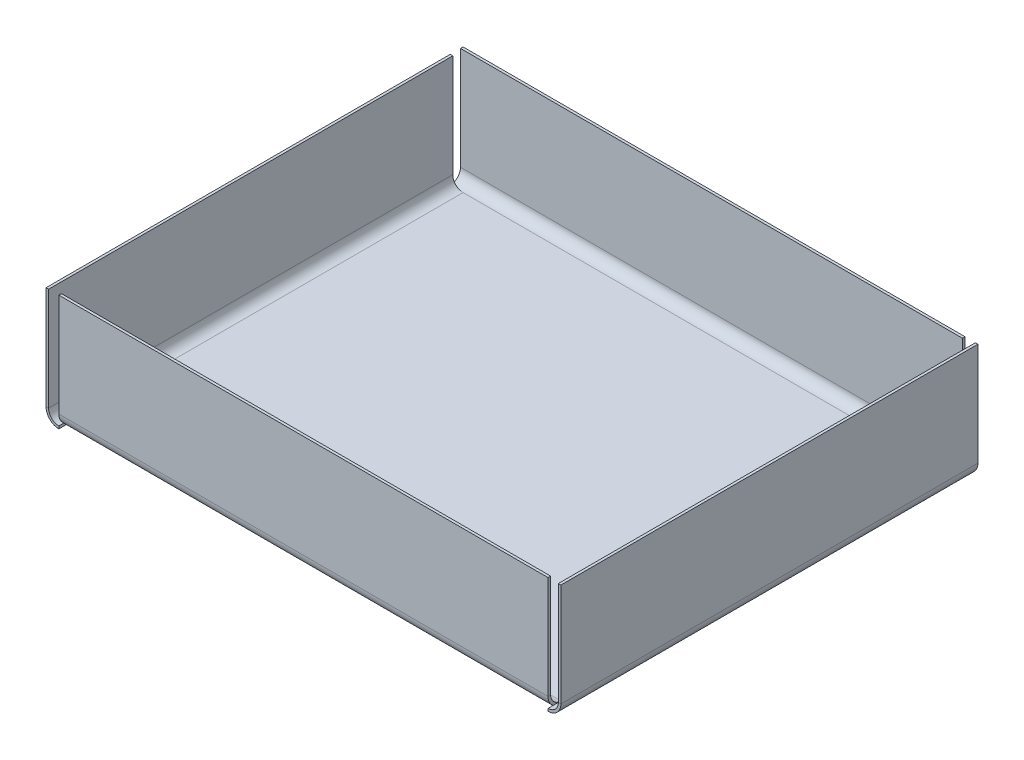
ISO-10303-21;
HEADER;
FILE_DESCRIPTION(('STEP AP214'),'2;1');
FILE_NAME('part.step','',(''),(''),'','','');
FILE_SCHEMA(('AUTOMOTIVE_DESIGN { 1 0 10303 214 1 1 1 1 }'));
ENDSEC;
DATA;
#1=APPLICATION_CONTEXT('core data for automotive mechanical design processes');
#2=APPLICATION_PROTOCOL_DEFINITION('international standard','automotive_design',2000,#1);
#3=PRODUCT_CONTEXT('',#1,'mechanical');
#4=PRODUCT('Part','Part','',(#3));
#5=PRODUCT_RELATED_PRODUCT_CATEGORY('part','',(#4));
#6=PRODUCT_DEFINITION_FORMATION('','',#4);
#7=PRODUCT_DEFINITION_CONTEXT('part definition',#1,'design');
#8=PRODUCT_DEFINITION('design','',#6,#7);
#9=PRODUCT_DEFINITION_SHAPE('','',#8);
#10=(LENGTH_UNIT() NAMED_UNIT(*) SI_UNIT(.MILLI.,.METRE.));
#11=(NAMED_UNIT(*) PLANE_ANGLE_UNIT() SI_UNIT($,.RADIAN.));
#12=(NAMED_UNIT(*) SI_UNIT($,.STERADIAN.) SOLID_ANGLE_UNIT());
#13=UNCERTAINTY_MEASURE_WITH_UNIT(LENGTH_MEASURE(1.E-05),#10,'distance_accuracy_value','');
#14=(GEOMETRIC_REPRESENTATION_CONTEXT(3) GLOBAL_UNCERTAINTY_ASSIGNED_CONTEXT((#13)) GLOBAL_UNIT_ASSIGNED_CONTEXT((#10,
#11,#12)) REPRESENTATION_CONTEXT('',''));
#15=CARTESIAN_POINT('',(0.,0.,0.));
#16=DIRECTION('',(0.,0.,1.));
#17=DIRECTION('',(1.,0.,0.));
#18=AXIS2_PLACEMENT_3D('',#15,#16,#17);
#19=CARTESIAN_POINT('',(97.5,1.99999999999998,78.5));
#20=DIRECTION('',(-1.,0.,0.));
#21=DIRECTION('',(0.,-1.,0.));
#22=AXIS2_PLACEMENT_3D('',#19,#20,#21);
#23=PLANE('',#22);
#24=CARTESIAN_POINT('',(97.5,1.99999999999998,78.5));
#25=DIRECTION('',(1.,0.,0.));
#26=DIRECTION('',(0.,1.,0.));
#27=AXIS2_PLACEMENT_3D('',#24,#25,#26);
#28=CIRCLE('',#27,2.5);
#29=CARTESIAN_POINT('',(97.5,1.99999999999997,81.));
#30=VERTEX_POINT('',#29);
#31=CARTESIAN_POINT('',(97.5,0.,80.));
#32=VERTEX_POINT('',#31);
#33=EDGE_CURVE('E36',#30,#32,#28,.T.);
#34=ORIENTED_EDGE('',*,*,#33,.T.);
#35=DIRECTION('',(0.,0.,-1.));
#36=VECTOR('',#35,1.);
#37=CARTESIAN_POINT('',(97.5,0.,81.));
#38=LINE('',#37,#36);
#39=CARTESIAN_POINT('',(97.5,0.,78.5));
#40=VERTEX_POINT('',#39);
#41=EDGE_CURVE('E11',#32,#40,#38,.T.);
#42=ORIENTED_EDGE('',*,*,#41,.T.);
#43=CARTESIAN_POINT('',(97.5,1.99999999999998,78.5));
#44=DIRECTION('',(1.,0.,0.));
#45=DIRECTION('',(0.,1.,0.));
#46=AXIS2_PLACEMENT_3D('',#43,#44,#45);
#47=CIRCLE('',#46,2.);
#48=CARTESIAN_POINT('',(97.5,1.99999999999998,80.5));
#49=VERTEX_POINT('',#48);
#50=EDGE_CURVE('E424',#49,#40,#47,.T.);
#51=ORIENTED_EDGE('',*,*,#50,.F.);
#52=DIRECTION('',(0.,0.,-1.));
#53=VECTOR('',#52,1.);
#54=CARTESIAN_POINT('',(97.5,1.99999999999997,80.5));
#55=LINE('',#54,#53);
#56=EDGE_CURVE('E242',#49,#30,#55,.F.);
#57=ORIENTED_EDGE('',*,*,#56,.T.);
#58=EDGE_LOOP('',(#34,#42,#51,#57));
#59=FACE_BOUND('',#58,.T.);
#60=ADVANCED_FACE('F33',(#59),#23,.F.);
#61=CARTESIAN_POINT('',(2.5,2.,78.5));
#62=DIRECTION('',(-1.,0.,0.));
#63=DIRECTION('',(0.,-1.,0.));
#64=AXIS2_PLACEMENT_3D('',#61,#62,#63);
#65=PLANE('',#64);
#66=DIRECTION('',(0.,0.,1.));
#67=VECTOR('',#66,1.);
#68=CARTESIAN_POINT('',(2.49999999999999,0.,81.));
#69=LINE('',#68,#67);
#70=CARTESIAN_POINT('',(2.5,0.,80.));
#71=VERTEX_POINT('',#70);
#72=CARTESIAN_POINT('',(2.5,0.,78.5));
#73=VERTEX_POINT('',#72);
#74=EDGE_CURVE('E41',#71,#73,#69,.F.);
#75=ORIENTED_EDGE('',*,*,#74,.F.);
#76=CARTESIAN_POINT('',(2.5,2.,78.5));
#77=DIRECTION('',(1.,0.,0.));
#78=DIRECTION('',(0.,1.,0.));
#79=AXIS2_PLACEMENT_3D('',#76,#77,#78);
#80=CIRCLE('',#79,2.5);
#81=CARTESIAN_POINT('',(2.5,2.,81.));
#82=VERTEX_POINT('',#81);
#83=EDGE_CURVE('E429',#71,#82,#80,.F.);
#84=ORIENTED_EDGE('',*,*,#83,.T.);
#85=DIRECTION('',(0.,0.,-1.));
#86=VECTOR('',#85,1.);
#87=CARTESIAN_POINT('',(2.49999999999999,2.,81.));
#88=LINE('',#87,#86);
#89=CARTESIAN_POINT('',(2.5,2.,80.5));
#90=VERTEX_POINT('',#89);
#91=EDGE_CURVE('E230',#90,#82,#88,.F.);
#92=ORIENTED_EDGE('',*,*,#91,.F.);
#93=CARTESIAN_POINT('',(2.5,2.,78.5));
#94=DIRECTION('',(1.,0.,0.));
#95=DIRECTION('',(0.,1.,0.));
#96=AXIS2_PLACEMENT_3D('',#93,#94,#95);
#97=CIRCLE('',#96,2.);
#98=EDGE_CURVE('E418',#73,#90,#97,.F.);
#99=ORIENTED_EDGE('',*,*,#98,.F.);
#100=EDGE_LOOP('',(#75,#84,#92,#99));
#101=FACE_BOUND('',#100,.T.);
#102=ADVANCED_FACE('F433',(#101),#65,.T.);
#103=CARTESIAN_POINT('',(97.5,1.99999999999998,78.5));
#104=DIRECTION('',(1.,0.,0.));
#105=DIRECTION('',(0.,0.,1.));
#106=AXIS2_PLACEMENT_3D('',#103,#104,#105);
#107=CYLINDRICAL_SURFACE('',#106,2.5);
#108=DIRECTION('',(1.,0.,0.));
#109=VECTOR('',#108,1.);
#110=CARTESIAN_POINT('',(97.5,-0.500000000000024,78.5));
#111=LINE('',#110,#109);
#112=CARTESIAN_POINT('',(97.5,-0.500000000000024,78.5));
#113=VERTEX_POINT('',#112);
#114=CARTESIAN_POINT('',(2.5,-0.500000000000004,78.5));
#115=VERTEX_POINT('',#114);
#116=EDGE_CURVE('E427',#113,#115,#111,.F.);
#117=ORIENTED_EDGE('',*,*,#116,.F.);
#118=EDGE_CURVE('E50',#32,#113,#28,.T.);
#119=ORIENTED_EDGE('',*,*,#118,.F.);
#120=ORIENTED_EDGE('',*,*,#33,.F.);
#121=DIRECTION('',(1.,0.,0.));
#122=VECTOR('',#121,1.);
#123=CARTESIAN_POINT('',(2.49999999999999,2.,81.));
#124=LINE('',#123,#122);
#125=EDGE_CURVE('E239',#30,#82,#124,.F.);
#126=ORIENTED_EDGE('',*,*,#125,.T.);
#127=ORIENTED_EDGE('',*,*,#83,.F.);
#128=EDGE_CURVE('E430',#115,#71,#80,.F.);
#129=ORIENTED_EDGE('',*,*,#128,.F.);
#130=EDGE_LOOP('',(#117,#119,#120,#126,#127,#129));
#131=FACE_BOUND('',#130,.T.);
#132=ADVANCED_FACE('F434',(#131),#107,.T.);
#133=CARTESIAN_POINT('',(97.5,1.99999999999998,78.5));
#134=DIRECTION('',(1.,0.,0.));
#135=DIRECTION('',(0.,0.,1.));
#136=AXIS2_PLACEMENT_3D('',#133,#134,#135);
#137=CYLINDRICAL_SURFACE('',#136,2.);
#138=DIRECTION('',(1.,0.,0.));
#139=VECTOR('',#138,1.);
#140=CARTESIAN_POINT('',(97.5,0.,78.5));
#141=LINE('',#140,#139);
#142=EDGE_CURVE('E421',#40,#73,#141,.F.);
#143=ORIENTED_EDGE('',*,*,#142,.T.);
#144=ORIENTED_EDGE('',*,*,#98,.T.);
#145=DIRECTION('',(1.,0.,0.));
#146=VECTOR('',#145,1.);
#147=CARTESIAN_POINT('',(2.49999999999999,2.,80.5));
#148=LINE('',#147,#146);
#149=EDGE_CURVE('E245',#90,#49,#148,.T.);
#150=ORIENTED_EDGE('',*,*,#149,.T.);
#151=ORIENTED_EDGE('',*,*,#50,.T.);
#152=EDGE_LOOP('',(#143,#144,#150,#151));
#153=FACE_BOUND('',#152,.T.);
#154=ADVANCED_FACE('F445',(#153),#137,.F.);
#155=CARTESIAN_POINT('',(0.,-0.5,81.));
#156=DIRECTION('',(0.,1.,0.));
#157=DIRECTION('',(0.,0.,1.));
#158=AXIS2_PLACEMENT_3D('',#155,#156,#157);
#159=PLANE('',#158);
#160=ORIENTED_EDGE('',*,*,#116,.T.);
#161=DIRECTION('',(0.,0.,1.));
#162=VECTOR('',#161,1.);
#163=CARTESIAN_POINT('',(2.49999999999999,-0.499999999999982,81.));
#164=LINE('',#163,#162);
#165=CARTESIAN_POINT('',(2.49999999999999,-0.499999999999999,2.5));
#166=VERTEX_POINT('',#165);
#167=EDGE_CURVE('E410',#115,#166,#164,.F.);
#168=ORIENTED_EDGE('',*,*,#167,.T.);
#169=DIRECTION('',(-1.,0.,0.));
#170=VECTOR('',#169,1.);
#171=CARTESIAN_POINT('',(0.,-0.500000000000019,2.49999999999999));
#172=LINE('',#171,#170);
#173=CARTESIAN_POINT('',(97.5,-0.500000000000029,2.49999999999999));
#174=VERTEX_POINT('',#173);
#175=EDGE_CURVE('E386',#166,#174,#172,.F.);
#176=ORIENTED_EDGE('',*,*,#175,.T.);
#177=DIRECTION('',(0.,0.,-1.));
#178=VECTOR('',#177,1.);
#179=CARTESIAN_POINT('',(97.5,-0.500000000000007,0.));
#180=LINE('',#179,#178);
#181=EDGE_CURVE('E360',#174,#113,#180,.F.);
#182=ORIENTED_EDGE('',*,*,#181,.T.);
#183=EDGE_LOOP('',(#160,#168,#176,#182));
#184=FACE_BOUND('',#183,.T.);
#185=ADVANCED_FACE('F518',(#184),#159,.F.);
#186=CARTESIAN_POINT('',(0.,0.,81.));
#187=DIRECTION('',(0.,1.,0.));
#188=DIRECTION('',(0.,0.,1.));
#189=AXIS2_PLACEMENT_3D('',#186,#187,#188);
#190=PLANE('',#189);
#191=CARTESIAN_POINT('',(2.49999999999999,0.,2.49999999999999));
#192=VERTEX_POINT('',#191);
#193=EDGE_CURVE('E402',#73,#192,#69,.F.);
#194=ORIENTED_EDGE('',*,*,#193,.F.);
#195=ORIENTED_EDGE('',*,*,#142,.F.);
#196=DIRECTION('',(0.,0.,-1.));
#197=VECTOR('',#196,1.);
#198=CARTESIAN_POINT('',(97.5,0.,0.));
#199=LINE('',#198,#197);
#200=CARTESIAN_POINT('',(97.5,0.,2.49999999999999));
#201=VERTEX_POINT('',#200);
#202=EDGE_CURVE('E352',#201,#40,#199,.F.);
#203=ORIENTED_EDGE('',*,*,#202,.F.);
#204=DIRECTION('',(-1.,0.,0.));
#205=VECTOR('',#204,1.);
#206=CARTESIAN_POINT('',(0.,0.,2.49999999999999));
#207=LINE('',#206,#205);
#208=EDGE_CURVE('E378',#192,#201,#207,.F.);
#209=ORIENTED_EDGE('',*,*,#208,.F.);
#210=EDGE_LOOP('',(#194,#195,#203,#209));
#211=FACE_BOUND('',#210,.T.);
#212=ADVANCED_FACE('F500',(#211),#190,.T.);
#213=CARTESIAN_POINT('',(2.49999999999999,2.,2.5));
#214=DIRECTION('',(0.,0.,-1.));
#215=DIRECTION('',(0.,1.,0.));
#216=AXIS2_PLACEMENT_3D('',#213,#214,#215);
#217=PLANE('',#216);
#218=CARTESIAN_POINT('',(1.00000000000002,0.,2.5));
#219=VERTEX_POINT('',#218);
#220=EDGE_CURVE('E379',#219,#192,#207,.F.);
#221=ORIENTED_EDGE('',*,*,#220,.F.);
#222=CARTESIAN_POINT('',(2.49999999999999,2.,2.5));
#223=DIRECTION('',(0.,0.,1.));
#224=DIRECTION('',(0.,-1.,0.));
#225=AXIS2_PLACEMENT_3D('',#222,#223,#224);
#226=CIRCLE('',#225,2.5);
#227=CARTESIAN_POINT('',(0.,1.99999999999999,2.5));
#228=VERTEX_POINT('',#227);
#229=EDGE_CURVE('E409',#219,#228,#226,.F.);
#230=ORIENTED_EDGE('',*,*,#229,.T.);
#231=DIRECTION('',(1.,0.,0.));
#232=VECTOR('',#231,1.);
#233=CARTESIAN_POINT('',(0.,1.99999999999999,2.49999999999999));
#234=LINE('',#233,#232);
#235=CARTESIAN_POINT('',(0.499999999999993,1.99999999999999,2.5));
#236=VERTEX_POINT('',#235);
#237=EDGE_CURVE('E252',#236,#228,#234,.F.);
#238=ORIENTED_EDGE('',*,*,#237,.F.);
#239=CARTESIAN_POINT('',(2.49999999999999,2.,2.5));
#240=DIRECTION('',(0.,0.,1.));
#241=DIRECTION('',(0.,-1.,0.));
#242=AXIS2_PLACEMENT_3D('',#239,#240,#241);
#243=CIRCLE('',#242,2.);
#244=EDGE_CURVE('E395',#192,#236,#243,.F.);
#245=ORIENTED_EDGE('',*,*,#244,.F.);
#246=EDGE_LOOP('',(#221,#230,#238,#245));
#247=FACE_BOUND('',#246,.T.);
#248=ADVANCED_FACE('F571',(#247),#217,.T.);
#249=CARTESIAN_POINT('',(2.49999999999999,2.00000000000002,81.));
#250=DIRECTION('',(0.,0.,-1.));
#251=DIRECTION('',(0.,1.,0.));
#252=AXIS2_PLACEMENT_3D('',#249,#250,#251);
#253=PLANE('',#252);
#254=CARTESIAN_POINT('',(2.49999999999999,2.00000000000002,81.));
#255=DIRECTION('',(0.,0.,1.));
#256=DIRECTION('',(0.,-1.,0.));
#257=AXIS2_PLACEMENT_3D('',#254,#255,#256);
#258=CIRCLE('',#257,2.);
#259=CARTESIAN_POINT('',(0.499999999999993,2.00000000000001,81.));
#260=VERTEX_POINT('',#259);
#261=CARTESIAN_POINT('',(2.49999999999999,0.,81.));
#262=VERTEX_POINT('',#261);
#263=EDGE_CURVE('E403',#260,#262,#258,.T.);
#264=ORIENTED_EDGE('',*,*,#263,.F.);
#265=DIRECTION('',(1.,0.,0.));
#266=VECTOR('',#265,1.);
#267=CARTESIAN_POINT('',(0.500000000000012,2.00000000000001,81.));
#268=LINE('',#267,#266);
#269=CARTESIAN_POINT('',(0.,2.00000000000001,81.));
#270=VERTEX_POINT('',#269);
#271=EDGE_CURVE('E277',#260,#270,#268,.F.);
#272=ORIENTED_EDGE('',*,*,#271,.T.);
#273=CARTESIAN_POINT('',(2.49999999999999,2.00000000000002,81.));
#274=DIRECTION('',(0.,0.,1.));
#275=DIRECTION('',(0.,-1.,0.));
#276=AXIS2_PLACEMENT_3D('',#273,#274,#275);
#277=CIRCLE('',#276,2.5);
#278=CARTESIAN_POINT('',(2.49999999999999,-0.5,81.));
#279=VERTEX_POINT('',#278);
#280=EDGE_CURVE('E398',#270,#279,#277,.T.);
#281=ORIENTED_EDGE('',*,*,#280,.T.);
#282=DIRECTION('',(0.,-1.,0.));
#283=VECTOR('',#282,1.);
#284=CARTESIAN_POINT('',(2.49999999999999,0.,81.));
#285=LINE('',#284,#283);
#286=EDGE_CURVE('E414',#262,#279,#285,.T.);
#287=ORIENTED_EDGE('',*,*,#286,.F.);
#288=EDGE_LOOP('',(#264,#272,#281,#287));
#289=FACE_BOUND('',#288,.T.);
#290=ADVANCED_FACE('F509',(#289),#253,.F.);
#291=CARTESIAN_POINT('',(2.49999999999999,2.00000000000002,81.));
#292=DIRECTION('',(0.,0.,1.));
#293=DIRECTION('',(-1.,0.,0.));
#294=AXIS2_PLACEMENT_3D('',#291,#292,#293);
#295=CYLINDRICAL_SURFACE('',#294,2.5);
#296=EDGE_CURVE('E406',#279,#115,#164,.F.);
#297=ORIENTED_EDGE('',*,*,#296,.F.);
#298=ORIENTED_EDGE('',*,*,#280,.F.);
#299=DIRECTION('',(0.,0.,1.));
#300=VECTOR('',#299,1.);
#301=CARTESIAN_POINT('',(0.,1.99999999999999,2.49999999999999));
#302=LINE('',#301,#300);
#303=EDGE_CURVE('E274',#270,#228,#302,.F.);
#304=ORIENTED_EDGE('',*,*,#303,.T.);
#305=ORIENTED_EDGE('',*,*,#229,.F.);
#306=EDGE_CURVE('E411',#166,#219,#226,.F.);
#307=ORIENTED_EDGE('',*,*,#306,.F.);
#308=ORIENTED_EDGE('',*,*,#167,.F.);
#309=EDGE_LOOP('',(#297,#298,#304,#305,#307,#308));
#310=FACE_BOUND('',#309,.T.);
#311=ADVANCED_FACE('F513',(#310),#295,.T.);
#312=CARTESIAN_POINT('',(2.49999999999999,2.00000000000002,81.));
#313=DIRECTION('',(0.,0.,1.));
#314=DIRECTION('',(-1.,0.,0.));
#315=AXIS2_PLACEMENT_3D('',#312,#313,#314);
#316=CYLINDRICAL_SURFACE('',#315,2.);
#317=EDGE_CURVE('E399',#262,#71,#69,.F.);
#318=ORIENTED_EDGE('',*,*,#317,.T.);
#319=ORIENTED_EDGE('',*,*,#74,.T.);
#320=ORIENTED_EDGE('',*,*,#193,.T.);
#321=ORIENTED_EDGE('',*,*,#244,.T.);
#322=DIRECTION('',(0.,0.,1.));
#323=VECTOR('',#322,1.);
#324=CARTESIAN_POINT('',(0.499999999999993,1.99999999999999,2.49999999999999));
#325=LINE('',#324,#323);
#326=EDGE_CURVE('E280',#236,#260,#325,.T.);
#327=ORIENTED_EDGE('',*,*,#326,.T.);
#328=ORIENTED_EDGE('',*,*,#263,.T.);
#329=EDGE_LOOP('',(#318,#319,#320,#321,#327,#328));
#330=FACE_BOUND('',#329,.T.);
#331=ADVANCED_FACE('F502',(#330),#316,.F.);
#332=CARTESIAN_POINT('',(97.5,1.99999999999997,2.49999999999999));
#333=DIRECTION('',(1.,0.,0.));
#334=DIRECTION('',(0.,1.,0.));
#335=AXIS2_PLACEMENT_3D('',#332,#333,#334);
#336=PLANE('',#335);
#337=CARTESIAN_POINT('',(97.5,0.,0.999999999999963));
#338=VERTEX_POINT('',#337);
#339=EDGE_CURVE('E353',#338,#201,#199,.F.);
#340=ORIENTED_EDGE('',*,*,#339,.F.);
#341=CARTESIAN_POINT('',(97.5,1.99999999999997,2.49999999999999));
#342=DIRECTION('',(-1.,0.,0.));
#343=DIRECTION('',(0.,-1.,0.));
#344=AXIS2_PLACEMENT_3D('',#341,#342,#343);
#345=CIRCLE('',#344,2.5);
#346=CARTESIAN_POINT('',(97.5,1.99999999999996,0.));
#347=VERTEX_POINT('',#346);
#348=EDGE_CURVE('E385',#338,#347,#345,.F.);
#349=ORIENTED_EDGE('',*,*,#348,.T.);
#350=DIRECTION('',(0.,0.,1.));
#351=VECTOR('',#350,1.);
#352=CARTESIAN_POINT('',(97.5,1.99999999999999,0.));
#353=LINE('',#352,#351);
#354=CARTESIAN_POINT('',(97.5,1.99999999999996,0.499999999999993));
#355=VERTEX_POINT('',#354);
#356=EDGE_CURVE('E256',#355,#347,#353,.F.);
#357=ORIENTED_EDGE('',*,*,#356,.F.);
#358=CARTESIAN_POINT('',(97.5,1.99999999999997,2.49999999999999));
#359=DIRECTION('',(-1.,0.,0.));
#360=DIRECTION('',(0.,-1.,0.));
#361=AXIS2_PLACEMENT_3D('',#358,#359,#360);
#362=CIRCLE('',#361,2.);
#363=EDGE_CURVE('E371',#201,#355,#362,.F.);
#364=ORIENTED_EDGE('',*,*,#363,.F.);
#365=EDGE_LOOP('',(#340,#349,#357,#364));
#366=FACE_BOUND('',#365,.T.);
#367=ADVANCED_FACE('F523',(#366),#336,.T.);
#368=CARTESIAN_POINT('',(0.,1.99999999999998,2.49999999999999));
#369=DIRECTION('',(1.,0.,0.));
#370=DIRECTION('',(0.,1.,0.));
#371=AXIS2_PLACEMENT_3D('',#368,#369,#370);
#372=PLANE('',#371);
#373=CARTESIAN_POINT('',(0.,1.99999999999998,2.49999999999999));
#374=DIRECTION('',(-1.,0.,0.));
#375=DIRECTION('',(0.,-1.,0.));
#376=AXIS2_PLACEMENT_3D('',#373,#374,#375);
#377=CIRCLE('',#376,2.);
#378=CARTESIAN_POINT('',(0.,1.99999999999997,0.499999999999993));
#379=VERTEX_POINT('',#378);
#380=CARTESIAN_POINT('',(0.,0.,2.49999999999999));
#381=VERTEX_POINT('',#380);
#382=EDGE_CURVE('E369',#379,#381,#377,.T.);
#383=ORIENTED_EDGE('',*,*,#382,.F.);
#384=DIRECTION('',(0.,0.,1.));
#385=VECTOR('',#384,1.);
#386=CARTESIAN_POINT('',(0.,1.99999999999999,0.499999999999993));
#387=LINE('',#386,#385);
#388=CARTESIAN_POINT('',(0.,2.,0.));
#389=VERTEX_POINT('',#388);
#390=EDGE_CURVE('E308',#379,#389,#387,.F.);
#391=ORIENTED_EDGE('',*,*,#390,.T.);
#392=CARTESIAN_POINT('',(0.,1.99999999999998,2.49999999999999));
#393=DIRECTION('',(-1.,0.,0.));
#394=DIRECTION('',(0.,-1.,0.));
#395=AXIS2_PLACEMENT_3D('',#392,#393,#394);
#396=CIRCLE('',#395,2.5);
#397=CARTESIAN_POINT('',(0.,-0.500000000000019,2.49999999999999));
#398=VERTEX_POINT('',#397);
#399=EDGE_CURVE('E374',#389,#398,#396,.T.);
#400=ORIENTED_EDGE('',*,*,#399,.T.);
#401=DIRECTION('',(0.,-1.,0.));
#402=VECTOR('',#401,1.);
#403=CARTESIAN_POINT('',(0.,0.,2.49999999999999));
#404=LINE('',#403,#402);
#405=EDGE_CURVE('E390',#381,#398,#404,.T.);
#406=ORIENTED_EDGE('',*,*,#405,.F.);
#407=EDGE_LOOP('',(#383,#391,#400,#406));
#408=FACE_BOUND('',#407,.T.);
#409=ADVANCED_FACE('F547',(#408),#372,.F.);
#410=CARTESIAN_POINT('',(0.,1.99999999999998,2.49999999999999));
#411=DIRECTION('',(-1.,0.,0.));
#412=DIRECTION('',(0.,0.,-1.));
#413=AXIS2_PLACEMENT_3D('',#410,#411,#412);
#414=CYLINDRICAL_SURFACE('',#413,2.5);
#415=EDGE_CURVE('E382',#398,#166,#172,.F.);
#416=ORIENTED_EDGE('',*,*,#415,.F.);
#417=ORIENTED_EDGE('',*,*,#399,.F.);
#418=DIRECTION('',(-1.,0.,0.));
#419=VECTOR('',#418,1.);
#420=CARTESIAN_POINT('',(97.5,1.99999999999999,0.));
#421=LINE('',#420,#419);
#422=EDGE_CURVE('E305',#389,#347,#421,.F.);
#423=ORIENTED_EDGE('',*,*,#422,.T.);
#424=ORIENTED_EDGE('',*,*,#348,.F.);
#425=EDGE_CURVE('E387',#174,#338,#345,.F.);
#426=ORIENTED_EDGE('',*,*,#425,.F.);
#427=ORIENTED_EDGE('',*,*,#175,.F.);
#428=EDGE_LOOP('',(#416,#417,#423,#424,#426,#427));
#429=FACE_BOUND('',#428,.T.);
#430=ADVANCED_FACE('F521',(#429),#414,.T.);
#431=CARTESIAN_POINT('',(0.,1.99999999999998,2.49999999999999));
#432=DIRECTION('',(-1.,0.,0.));
#433=DIRECTION('',(0.,0.,-1.));
#434=AXIS2_PLACEMENT_3D('',#431,#432,#433);
#435=CYLINDRICAL_SURFACE('',#434,2.);
#436=EDGE_CURVE('E375',#381,#219,#207,.F.);
#437=ORIENTED_EDGE('',*,*,#436,.T.);
#438=ORIENTED_EDGE('',*,*,#220,.T.);
#439=ORIENTED_EDGE('',*,*,#208,.T.);
#440=ORIENTED_EDGE('',*,*,#363,.T.);
#441=DIRECTION('',(-1.,0.,0.));
#442=VECTOR('',#441,1.);
#443=CARTESIAN_POINT('',(97.5,1.99999999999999,0.499999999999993));
#444=LINE('',#443,#442);
#445=EDGE_CURVE('E311',#355,#379,#444,.T.);
#446=ORIENTED_EDGE('',*,*,#445,.T.);
#447=ORIENTED_EDGE('',*,*,#382,.T.);
#448=EDGE_LOOP('',(#437,#438,#439,#440,#446,#447));
#449=FACE_BOUND('',#448,.T.);
#450=ADVANCED_FACE('F528',(#449),#435,.F.);
#451=CARTESIAN_POINT('',(97.5,2.,81.));
#452=DIRECTION('',(0.,0.,1.));
#453=DIRECTION('',(1.,0.,0.));
#454=AXIS2_PLACEMENT_3D('',#451,#452,#453);
#455=PLANE('',#454);
#456=DIRECTION('',(-1.,0.,0.));
#457=VECTOR('',#456,1.);
#458=CARTESIAN_POINT('',(100.,1.99999999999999,81.));
#459=LINE('',#458,#457);
#460=CARTESIAN_POINT('',(99.5,1.99999999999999,81.));
#461=VERTEX_POINT('',#460);
#462=CARTESIAN_POINT('',(100.,1.99999999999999,81.));
#463=VERTEX_POINT('',#462);
#464=EDGE_CURVE('E287',#461,#463,#459,.F.);
#465=ORIENTED_EDGE('',*,*,#464,.F.);
#466=CARTESIAN_POINT('',(97.5,2.,81.));
#467=DIRECTION('',(0.,0.,-1.));
#468=DIRECTION('',(-1.,0.,0.));
#469=AXIS2_PLACEMENT_3D('',#466,#467,#468);
#470=CIRCLE('',#469,2.);
#471=CARTESIAN_POINT('',(97.5,0.,81.));
#472=VERTEX_POINT('',#471);
#473=EDGE_CURVE('E345',#472,#461,#470,.F.);
#474=ORIENTED_EDGE('',*,*,#473,.F.);
#475=DIRECTION('',(0.,-1.,0.));
#476=VECTOR('',#475,1.);
#477=CARTESIAN_POINT('',(97.5,0.,81.));
#478=LINE('',#477,#476);
#479=CARTESIAN_POINT('',(97.5,-0.500000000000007,81.));
#480=VERTEX_POINT('',#479);
#481=EDGE_CURVE('E366',#472,#480,#478,.T.);
#482=ORIENTED_EDGE('',*,*,#481,.T.);
#483=CARTESIAN_POINT('',(97.5,2.,81.));
#484=DIRECTION('',(0.,0.,-1.));
#485=DIRECTION('',(-1.,0.,0.));
#486=AXIS2_PLACEMENT_3D('',#483,#484,#485);
#487=CIRCLE('',#486,2.5);
#488=EDGE_CURVE('E359',#480,#463,#487,.F.);
#489=ORIENTED_EDGE('',*,*,#488,.T.);
#490=EDGE_LOOP('',(#465,#474,#482,#489));
#491=FACE_BOUND('',#490,.T.);
#492=ADVANCED_FACE('F460',(#491),#455,.T.);
#493=CARTESIAN_POINT('',(97.5,2.,0.));
#494=DIRECTION('',(0.,0.,1.));
#495=DIRECTION('',(1.,0.,0.));
#496=AXIS2_PLACEMENT_3D('',#493,#494,#495);
#497=PLANE('',#496);
#498=CARTESIAN_POINT('',(97.5,2.,0.));
#499=DIRECTION('',(0.,0.,-1.));
#500=DIRECTION('',(-1.,0.,0.));
#501=AXIS2_PLACEMENT_3D('',#498,#499,#500);
#502=CIRCLE('',#501,2.);
#503=CARTESIAN_POINT('',(99.5,1.99999999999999,0.));
#504=VERTEX_POINT('',#503);
#505=CARTESIAN_POINT('',(97.5,0.,0.));
#506=VERTEX_POINT('',#505);
#507=EDGE_CURVE('E318',#504,#506,#502,.T.);
#508=ORIENTED_EDGE('',*,*,#507,.F.);
#509=DIRECTION('',(-1.,0.,0.));
#510=VECTOR('',#509,1.);
#511=CARTESIAN_POINT('',(99.5,1.99999999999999,0.));
#512=LINE('',#511,#510);
#513=CARTESIAN_POINT('',(100.,1.99999999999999,0.));
#514=VERTEX_POINT('',#513);
#515=EDGE_CURVE('E338',#504,#514,#512,.F.);
#516=ORIENTED_EDGE('',*,*,#515,.T.);
#517=CARTESIAN_POINT('',(97.5,2.,0.));
#518=DIRECTION('',(0.,0.,-1.));
#519=DIRECTION('',(-1.,0.,0.));
#520=AXIS2_PLACEMENT_3D('',#517,#518,#519);
#521=CIRCLE('',#520,2.5);
#522=CARTESIAN_POINT('',(97.5,-0.5,0.));
#523=VERTEX_POINT('',#522);
#524=EDGE_CURVE('E348',#514,#523,#521,.T.);
#525=ORIENTED_EDGE('',*,*,#524,.T.);
#526=DIRECTION('',(0.,-1.,0.));
#527=VECTOR('',#526,1.);
#528=CARTESIAN_POINT('',(97.5,0.,0.));
#529=LINE('',#528,#527);
#530=EDGE_CURVE('E363',#506,#523,#529,.T.);
#531=ORIENTED_EDGE('',*,*,#530,.F.);
#532=EDGE_LOOP('',(#508,#516,#525,#531));
#533=FACE_BOUND('',#532,.T.);
#534=ADVANCED_FACE('F482',(#533),#497,.F.);
#535=CARTESIAN_POINT('',(97.5,2.,0.));
#536=DIRECTION('',(0.,0.,-1.));
#537=DIRECTION('',(1.,0.,0.));
#538=AXIS2_PLACEMENT_3D('',#535,#536,#537);
#539=CYLINDRICAL_SURFACE('',#538,2.5);
#540=EDGE_CURVE('E356',#523,#174,#180,.F.);
#541=ORIENTED_EDGE('',*,*,#540,.F.);
#542=ORIENTED_EDGE('',*,*,#524,.F.);
#543=DIRECTION('',(0.,0.,-1.));
#544=VECTOR('',#543,1.);
#545=CARTESIAN_POINT('',(100.,1.99999999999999,81.));
#546=LINE('',#545,#544);
#547=EDGE_CURVE('E336',#514,#463,#546,.F.);
#548=ORIENTED_EDGE('',*,*,#547,.T.);
#549=ORIENTED_EDGE('',*,*,#488,.F.);
#550=DIRECTION('',(0.,0.,-1.));
#551=VECTOR('',#550,1.);
#552=CARTESIAN_POINT('',(97.5,-0.500000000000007,0.));
#553=LINE('',#552,#551);
#554=EDGE_CURVE('E249',#480,#113,#553,.T.);
#555=ORIENTED_EDGE('',*,*,#554,.T.);
#556=ORIENTED_EDGE('',*,*,#181,.F.);
#557=EDGE_LOOP('',(#541,#542,#548,#549,#555,#556));
#558=FACE_BOUND('',#557,.T.);
#559=ADVANCED_FACE('F488',(#558),#539,.T.);
#560=CARTESIAN_POINT('',(97.5,2.,0.));
#561=DIRECTION('',(0.,0.,-1.));
#562=DIRECTION('',(1.,0.,0.));
#563=AXIS2_PLACEMENT_3D('',#560,#561,#562);
#564=CYLINDRICAL_SURFACE('',#563,2.);
#565=EDGE_CURVE('E349',#506,#338,#199,.F.);
#566=ORIENTED_EDGE('',*,*,#565,.T.);
#567=ORIENTED_EDGE('',*,*,#339,.T.);
#568=ORIENTED_EDGE('',*,*,#202,.T.);
#569=ORIENTED_EDGE('',*,*,#41,.F.);
#570=EDGE_CURVE('E43',#472,#32,#38,.T.);
#571=ORIENTED_EDGE('',*,*,#570,.F.);
#572=ORIENTED_EDGE('',*,*,#473,.T.);
#573=DIRECTION('',(0.,0.,-1.));
#574=VECTOR('',#573,1.);
#575=CARTESIAN_POINT('',(99.5,1.99999999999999,81.));
#576=LINE('',#575,#574);
#577=EDGE_CURVE('E341',#461,#504,#576,.T.);
#578=ORIENTED_EDGE('',*,*,#577,.T.);
#579=ORIENTED_EDGE('',*,*,#507,.T.);
#580=EDGE_LOOP('',(#566,#567,#568,#569,#571,#572,#578,#579));
#581=FACE_BOUND('',#580,.T.);
#582=ADVANCED_FACE('F452',(#581),#564,.F.);
#583=CARTESIAN_POINT('',(100.,22.,0.));
#584=DIRECTION('',(0.,0.,1.));
#585=DIRECTION('',(1.,0.,0.));
#586=AXIS2_PLACEMENT_3D('',#583,#584,#585);
#587=PLANE('',#586);
#588=ORIENTED_EDGE('',*,*,#515,.F.);
#589=DIRECTION('',(0.,-1.,0.));
#590=VECTOR('',#589,1.);
#591=CARTESIAN_POINT('',(99.5000000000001,22.,0.));
#592=LINE('',#591,#590);
#593=CARTESIAN_POINT('',(99.5000000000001,22.,0.));
#594=VERTEX_POINT('',#593);
#595=EDGE_CURVE('E334',#504,#594,#592,.F.);
#596=ORIENTED_EDGE('',*,*,#595,.T.);
#597=DIRECTION('',(-1.,0.,0.));
#598=VECTOR('',#597,1.);
#599=CARTESIAN_POINT('',(100.,22.,0.));
#600=LINE('',#599,#598);
#601=CARTESIAN_POINT('',(100.,22.,0.));
#602=VERTEX_POINT('',#601);
#603=EDGE_CURVE('E315',#602,#594,#600,.T.);
#604=ORIENTED_EDGE('',*,*,#603,.F.);
#605=DIRECTION('',(0.,1.,0.));
#606=VECTOR('',#605,1.);
#607=CARTESIAN_POINT('',(100.,0.,0.));
#608=LINE('',#607,#606);
#609=EDGE_CURVE('E327',#514,#602,#608,.T.);
#610=ORIENTED_EDGE('',*,*,#609,.F.);
#611=EDGE_LOOP('',(#588,#596,#604,#610));
#612=FACE_BOUND('',#611,.T.);
#613=ADVANCED_FACE('F479',(#612),#587,.F.);
#614=CARTESIAN_POINT('',(100.,0.,81.));
#615=DIRECTION('',(0.,0.,-1.));
#616=DIRECTION('',(-1.,0.,0.));
#617=AXIS2_PLACEMENT_3D('',#614,#615,#616);
#618=PLANE('',#617);
#619=ORIENTED_EDGE('',*,*,#464,.T.);
#620=DIRECTION('',(0.,-1.,0.));
#621=VECTOR('',#620,1.);
#622=CARTESIAN_POINT('',(100.,0.,81.));
#623=LINE('',#622,#621);
#624=CARTESIAN_POINT('',(100.,22.,81.));
#625=VERTEX_POINT('',#624);
#626=EDGE_CURVE('E322',#625,#463,#623,.T.);
#627=ORIENTED_EDGE('',*,*,#626,.F.);
#628=DIRECTION('',(-1.,0.,0.));
#629=VECTOR('',#628,1.);
#630=CARTESIAN_POINT('',(100.,22.,81.));
#631=LINE('',#630,#629);
#632=CARTESIAN_POINT('',(99.5000000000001,22.,81.));
#633=VERTEX_POINT('',#632);
#634=EDGE_CURVE('E319',#625,#633,#631,.T.);
#635=ORIENTED_EDGE('',*,*,#634,.T.);
#636=DIRECTION('',(0.,1.,0.));
#637=VECTOR('',#636,1.);
#638=CARTESIAN_POINT('',(99.5,0.,81.));
#639=LINE('',#638,#637);
#640=EDGE_CURVE('E329',#633,#461,#639,.F.);
#641=ORIENTED_EDGE('',*,*,#640,.T.);
#642=EDGE_LOOP('',(#619,#627,#635,#641));
#643=FACE_BOUND('',#642,.T.);
#644=ADVANCED_FACE('F469',(#643),#618,.F.);
#645=CARTESIAN_POINT('',(100.,0.,0.));
#646=DIRECTION('',(-1.,0.,0.));
#647=DIRECTION('',(0.,-1.,0.));
#648=AXIS2_PLACEMENT_3D('',#645,#646,#647);
#649=PLANE('',#648);
#650=ORIENTED_EDGE('',*,*,#547,.F.);
#651=ORIENTED_EDGE('',*,*,#609,.T.);
#652=DIRECTION('',(0.,0.,1.));
#653=VECTOR('',#652,1.);
#654=CARTESIAN_POINT('',(100.,22.,0.));
#655=LINE('',#654,#653);
#656=EDGE_CURVE('E325',#602,#625,#655,.T.);
#657=ORIENTED_EDGE('',*,*,#656,.T.);
#658=ORIENTED_EDGE('',*,*,#626,.T.);
#659=EDGE_LOOP('',(#650,#651,#657,#658));
#660=FACE_BOUND('',#659,.T.);
#661=ADVANCED_FACE('F485',(#660),#649,.F.);
#662=CARTESIAN_POINT('',(99.5,0.,0.));
#663=DIRECTION('',(-1.,0.,0.));
#664=DIRECTION('',(0.,-1.,0.));
#665=AXIS2_PLACEMENT_3D('',#662,#663,#664);
#666=PLANE('',#665);
#667=ORIENTED_EDGE('',*,*,#595,.F.);
#668=ORIENTED_EDGE('',*,*,#577,.F.);
#669=ORIENTED_EDGE('',*,*,#640,.F.);
#670=DIRECTION('',(0.,0.,-1.));
#671=VECTOR('',#670,1.);
#672=CARTESIAN_POINT('',(99.5000000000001,22.,81.));
#673=LINE('',#672,#671);
#674=EDGE_CURVE('E332',#594,#633,#673,.F.);
#675=ORIENTED_EDGE('',*,*,#674,.F.);
#676=EDGE_LOOP('',(#667,#668,#669,#675));
#677=FACE_BOUND('',#676,.T.);
#678=ADVANCED_FACE('F466',(#677),#666,.T.);
#679=CARTESIAN_POINT('',(100.,22.,81.));
#680=DIRECTION('',(0.,-1.,0.));
#681=DIRECTION('',(1.,0.,0.));
#682=AXIS2_PLACEMENT_3D('',#679,#680,#681);
#683=PLANE('',#682);
#684=ORIENTED_EDGE('',*,*,#674,.T.);
#685=ORIENTED_EDGE('',*,*,#634,.F.);
#686=ORIENTED_EDGE('',*,*,#656,.F.);
#687=ORIENTED_EDGE('',*,*,#603,.T.);
#688=EDGE_LOOP('',(#684,#685,#686,#687));
#689=FACE_BOUND('',#688,.T.);
#690=ADVANCED_FACE('F474',(#689),#683,.F.);
#691=CARTESIAN_POINT('',(97.5,0.,2.49999999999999));
#692=DIRECTION('',(-1.,0.,0.));
#693=DIRECTION('',(0.,0.,1.));
#694=AXIS2_PLACEMENT_3D('',#691,#692,#693);
#695=PLANE('',#694);
#696=ORIENTED_EDGE('',*,*,#540,.T.);
#697=ORIENTED_EDGE('',*,*,#425,.T.);
#698=ORIENTED_EDGE('',*,*,#565,.F.);
#699=ORIENTED_EDGE('',*,*,#530,.T.);
#700=EDGE_LOOP('',(#696,#697,#698,#699));
#701=FACE_BOUND('',#700,.T.);
#702=ADVANCED_FACE('F492',(#701),#695,.T.);
#703=CARTESIAN_POINT('',(0.,22.,0.));
#704=DIRECTION('',(1.,0.,0.));
#705=DIRECTION('',(0.,1.,0.));
#706=AXIS2_PLACEMENT_3D('',#703,#704,#705);
#707=PLANE('',#706);
#708=ORIENTED_EDGE('',*,*,#390,.F.);
#709=DIRECTION('',(0.,-1.,0.));
#710=VECTOR('',#709,1.);
#711=CARTESIAN_POINT('',(0.,22.,0.499999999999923));
#712=LINE('',#711,#710);
#713=CARTESIAN_POINT('',(0.,22.,0.499999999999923));
#714=VERTEX_POINT('',#713);
#715=EDGE_CURVE('E303',#379,#714,#712,.F.);
#716=ORIENTED_EDGE('',*,*,#715,.T.);
#717=DIRECTION('',(0.,0.,1.));
#718=VECTOR('',#717,1.);
#719=CARTESIAN_POINT('',(0.,22.,0.));
#720=LINE('',#719,#718);
#721=CARTESIAN_POINT('',(0.,22.,0.));
#722=VERTEX_POINT('',#721);
#723=EDGE_CURVE('E284',#722,#714,#720,.T.);
#724=ORIENTED_EDGE('',*,*,#723,.F.);
#725=DIRECTION('',(0.,1.,0.));
#726=VECTOR('',#725,1.);
#727=CARTESIAN_POINT('',(0.,0.,0.));
#728=LINE('',#727,#726);
#729=EDGE_CURVE('E296',#389,#722,#728,.T.);
#730=ORIENTED_EDGE('',*,*,#729,.F.);
#731=EDGE_LOOP('',(#708,#716,#724,#730));
#732=FACE_BOUND('',#731,.T.);
#733=ADVANCED_FACE('F545',(#732),#707,.F.);
#734=CARTESIAN_POINT('',(97.5,0.,0.));
#735=DIRECTION('',(-1.,0.,0.));
#736=DIRECTION('',(0.,0.,1.));
#737=AXIS2_PLACEMENT_3D('',#734,#735,#736);
#738=PLANE('',#737);
#739=ORIENTED_EDGE('',*,*,#356,.T.);
#740=DIRECTION('',(0.,-1.,0.));
#741=VECTOR('',#740,1.);
#742=CARTESIAN_POINT('',(97.5,0.,0.));
#743=LINE('',#742,#741);
#744=CARTESIAN_POINT('',(97.5,22.,0.));
#745=VERTEX_POINT('',#744);
#746=EDGE_CURVE('E291',#745,#347,#743,.T.);
#747=ORIENTED_EDGE('',*,*,#746,.F.);
#748=DIRECTION('',(0.,0.,1.));
#749=VECTOR('',#748,1.);
#750=CARTESIAN_POINT('',(97.5,22.,0.));
#751=LINE('',#750,#749);
#752=CARTESIAN_POINT('',(97.5,22.,0.499999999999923));
#753=VERTEX_POINT('',#752);
#754=EDGE_CURVE('E288',#745,#753,#751,.T.);
#755=ORIENTED_EDGE('',*,*,#754,.T.);
#756=DIRECTION('',(0.,1.,0.));
#757=VECTOR('',#756,1.);
#758=CARTESIAN_POINT('',(97.5,0.,0.5));
#759=LINE('',#758,#757);
#760=EDGE_CURVE('E298',#753,#355,#759,.F.);
#761=ORIENTED_EDGE('',*,*,#760,.T.);
#762=EDGE_LOOP('',(#739,#747,#755,#761));
#763=FACE_BOUND('',#762,.T.);
#764=ADVANCED_FACE('F536',(#763),#738,.F.);
#765=CARTESIAN_POINT('',(97.5,0.,0.));
#766=DIRECTION('',(0.,0.,1.));
#767=DIRECTION('',(0.,-1.,0.));
#768=AXIS2_PLACEMENT_3D('',#765,#766,#767);
#769=PLANE('',#768);
#770=ORIENTED_EDGE('',*,*,#422,.F.);
#771=ORIENTED_EDGE('',*,*,#729,.T.);
#772=DIRECTION('',(1.,0.,0.));
#773=VECTOR('',#772,1.);
#774=CARTESIAN_POINT('',(97.5,22.,0.));
#775=LINE('',#774,#773);
#776=EDGE_CURVE('E294',#722,#745,#775,.T.);
#777=ORIENTED_EDGE('',*,*,#776,.T.);
#778=ORIENTED_EDGE('',*,*,#746,.T.);
#779=EDGE_LOOP('',(#770,#771,#777,#778));
#780=FACE_BOUND('',#779,.T.);
#781=ADVANCED_FACE('F549',(#780),#769,.F.);
#782=CARTESIAN_POINT('',(97.5,0.,0.5));
#783=DIRECTION('',(0.,0.,1.));
#784=DIRECTION('',(0.,-1.,0.));
#785=AXIS2_PLACEMENT_3D('',#782,#783,#784);
#786=PLANE('',#785);
#787=ORIENTED_EDGE('',*,*,#715,.F.);
#788=ORIENTED_EDGE('',*,*,#445,.F.);
#789=ORIENTED_EDGE('',*,*,#760,.F.);
#790=DIRECTION('',(-1.,0.,0.));
#791=VECTOR('',#790,1.);
#792=CARTESIAN_POINT('',(97.5,22.,0.499999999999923));
#793=LINE('',#792,#791);
#794=EDGE_CURVE('E301',#714,#753,#793,.F.);
#795=ORIENTED_EDGE('',*,*,#794,.F.);
#796=EDGE_LOOP('',(#787,#788,#789,#795));
#797=FACE_BOUND('',#796,.T.);
#798=ADVANCED_FACE('F534',(#797),#786,.T.);
#799=CARTESIAN_POINT('',(97.5,22.,0.));
#800=DIRECTION('',(0.,-1.,0.));
#801=DIRECTION('',(0.,0.,-1.));
#802=AXIS2_PLACEMENT_3D('',#799,#800,#801);
#803=PLANE('',#802);
#804=ORIENTED_EDGE('',*,*,#794,.T.);
#805=ORIENTED_EDGE('',*,*,#754,.F.);
#806=ORIENTED_EDGE('',*,*,#776,.F.);
#807=ORIENTED_EDGE('',*,*,#723,.T.);
#808=EDGE_LOOP('',(#804,#805,#806,#807));
#809=FACE_BOUND('',#808,.T.);
#810=ADVANCED_FACE('F540',(#809),#803,.F.);
#811=CARTESIAN_POINT('',(2.49999999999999,0.,2.5));
#812=DIRECTION('',(0.,0.,1.));
#813=DIRECTION('',(1.,0.,0.));
#814=AXIS2_PLACEMENT_3D('',#811,#812,#813);
#815=PLANE('',#814);
#816=ORIENTED_EDGE('',*,*,#415,.T.);
#817=ORIENTED_EDGE('',*,*,#306,.T.);
#818=ORIENTED_EDGE('',*,*,#436,.F.);
#819=ORIENTED_EDGE('',*,*,#405,.T.);
#820=EDGE_LOOP('',(#816,#817,#818,#819));
#821=FACE_BOUND('',#820,.T.);
#822=ADVANCED_FACE('F614',(#821),#815,.T.);
#823=CARTESIAN_POINT('',(0.,22.,81.));
#824=DIRECTION('',(0.,0.,-1.));
#825=DIRECTION('',(-1.,0.,0.));
#826=AXIS2_PLACEMENT_3D('',#823,#824,#825);
#827=PLANE('',#826);
#828=ORIENTED_EDGE('',*,*,#271,.F.);
#829=DIRECTION('',(0.,-1.,0.));
#830=VECTOR('',#829,1.);
#831=CARTESIAN_POINT('',(0.499999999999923,22.,81.));
#832=LINE('',#831,#830);
#833=CARTESIAN_POINT('',(0.499999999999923,22.,81.));
#834=VERTEX_POINT('',#833);
#835=EDGE_CURVE('E272',#260,#834,#832,.F.);
#836=ORIENTED_EDGE('',*,*,#835,.T.);
#837=DIRECTION('',(1.,0.,0.));
#838=VECTOR('',#837,1.);
#839=CARTESIAN_POINT('',(0.,22.,81.));
#840=LINE('',#839,#838);
#841=CARTESIAN_POINT('',(0.,22.,81.));
#842=VERTEX_POINT('',#841);
#843=EDGE_CURVE('E253',#842,#834,#840,.T.);
#844=ORIENTED_EDGE('',*,*,#843,.F.);
#845=DIRECTION('',(0.,1.,0.));
#846=VECTOR('',#845,1.);
#847=CARTESIAN_POINT('',(0.,0.,81.));
#848=LINE('',#847,#846);
#849=EDGE_CURVE('E265',#270,#842,#848,.T.);
#850=ORIENTED_EDGE('',*,*,#849,.F.);
#851=EDGE_LOOP('',(#828,#836,#844,#850));
#852=FACE_BOUND('',#851,.T.);
#853=ADVANCED_FACE('F618',(#852),#827,.F.);
#854=CARTESIAN_POINT('',(0.,0.,2.49999999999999));
#855=DIRECTION('',(0.,0.,1.));
#856=DIRECTION('',(0.,-1.,0.));
#857=AXIS2_PLACEMENT_3D('',#854,#855,#856);
#858=PLANE('',#857);
#859=ORIENTED_EDGE('',*,*,#237,.T.);
#860=DIRECTION('',(0.,-1.,0.));
#861=VECTOR('',#860,1.);
#862=CARTESIAN_POINT('',(0.,0.,2.49999999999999));
#863=LINE('',#862,#861);
#864=CARTESIAN_POINT('',(0.,22.,2.49999999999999));
#865=VERTEX_POINT('',#864);
#866=EDGE_CURVE('E260',#865,#228,#863,.T.);
#867=ORIENTED_EDGE('',*,*,#866,.F.);
#868=DIRECTION('',(1.,0.,0.));
#869=VECTOR('',#868,1.);
#870=CARTESIAN_POINT('',(0.,22.,2.49999999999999));
#871=LINE('',#870,#869);
#872=CARTESIAN_POINT('',(0.499999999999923,22.,2.49999999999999));
#873=VERTEX_POINT('',#872);
#874=EDGE_CURVE('E257',#865,#873,#871,.T.);
#875=ORIENTED_EDGE('',*,*,#874,.T.);
#876=DIRECTION('',(0.,1.,0.));
#877=VECTOR('',#876,1.);
#878=CARTESIAN_POINT('',(0.5,0.,2.49999999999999));
#879=LINE('',#878,#877);
#880=EDGE_CURVE('E267',#873,#236,#879,.F.);
#881=ORIENTED_EDGE('',*,*,#880,.T.);
#882=EDGE_LOOP('',(#859,#867,#875,#881));
#883=FACE_BOUND('',#882,.T.);
#884=ADVANCED_FACE('F624',(#883),#858,.F.);
#885=CARTESIAN_POINT('',(0.,0.,81.));
#886=DIRECTION('',(1.,0.,0.));
#887=DIRECTION('',(0.,1.,0.));
#888=AXIS2_PLACEMENT_3D('',#885,#886,#887);
#889=PLANE('',#888);
#890=ORIENTED_EDGE('',*,*,#303,.F.);
#891=ORIENTED_EDGE('',*,*,#849,.T.);
#892=DIRECTION('',(0.,0.,-1.));
#893=VECTOR('',#892,1.);
#894=CARTESIAN_POINT('',(0.,22.,81.));
#895=LINE('',#894,#893);
#896=EDGE_CURVE('E263',#842,#865,#895,.T.);
#897=ORIENTED_EDGE('',*,*,#896,.T.);
#898=ORIENTED_EDGE('',*,*,#866,.T.);
#899=EDGE_LOOP('',(#890,#891,#897,#898));
#900=FACE_BOUND('',#899,.T.);
#901=ADVANCED_FACE('F635',(#900),#889,.F.);
#902=CARTESIAN_POINT('',(0.5,0.,81.));
#903=DIRECTION('',(1.,0.,0.));
#904=DIRECTION('',(0.,1.,0.));
#905=AXIS2_PLACEMENT_3D('',#902,#903,#904);
#906=PLANE('',#905);
#907=ORIENTED_EDGE('',*,*,#835,.F.);
#908=ORIENTED_EDGE('',*,*,#326,.F.);
#909=ORIENTED_EDGE('',*,*,#880,.F.);
#910=DIRECTION('',(0.,0.,1.));
#911=VECTOR('',#910,1.);
#912=CARTESIAN_POINT('',(0.499999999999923,22.,2.49999999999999));
#913=LINE('',#912,#911);
#914=EDGE_CURVE('E270',#834,#873,#913,.F.);
#915=ORIENTED_EDGE('',*,*,#914,.F.);
#916=EDGE_LOOP('',(#907,#908,#909,#915));
#917=FACE_BOUND('',#916,.T.);
#918=ADVANCED_FACE('F631',(#917),#906,.T.);
#919=CARTESIAN_POINT('',(0.,22.,2.49999999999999));
#920=DIRECTION('',(0.,-1.,0.));
#921=DIRECTION('',(1.,0.,0.));
#922=AXIS2_PLACEMENT_3D('',#919,#920,#921);
#923=PLANE('',#922);
#924=ORIENTED_EDGE('',*,*,#914,.T.);
#925=ORIENTED_EDGE('',*,*,#874,.F.);
#926=ORIENTED_EDGE('',*,*,#896,.F.);
#927=ORIENTED_EDGE('',*,*,#843,.T.);
#928=EDGE_LOOP('',(#924,#925,#926,#927));
#929=FACE_BOUND('',#928,.T.);
#930=ADVANCED_FACE('F628',(#929),#923,.F.);
#931=CARTESIAN_POINT('',(2.5,0.,78.5));
#932=DIRECTION('',(1.,0.,0.));
#933=DIRECTION('',(0.,0.,-1.));
#934=AXIS2_PLACEMENT_3D('',#931,#932,#933);
#935=PLANE('',#934);
#936=ORIENTED_EDGE('',*,*,#296,.T.);
#937=ORIENTED_EDGE('',*,*,#128,.T.);
#938=ORIENTED_EDGE('',*,*,#317,.F.);
#939=ORIENTED_EDGE('',*,*,#286,.T.);
#940=EDGE_LOOP('',(#936,#937,#938,#939));
#941=FACE_BOUND('',#940,.T.);
#942=ADVANCED_FACE('F506',(#941),#935,.T.);
#943=CARTESIAN_POINT('',(97.5,0.,81.));
#944=DIRECTION('',(-1.,0.,0.));
#945=DIRECTION('',(0.,0.,1.));
#946=AXIS2_PLACEMENT_3D('',#943,#944,#945);
#947=PLANE('',#946);
#948=ORIENTED_EDGE('',*,*,#570,.T.);
#949=ORIENTED_EDGE('',*,*,#118,.T.);
#950=ORIENTED_EDGE('',*,*,#554,.F.);
#951=ORIENTED_EDGE('',*,*,#481,.F.);
#952=EDGE_LOOP('',(#948,#949,#950,#951));
#953=FACE_BOUND('',#952,.T.);
#954=ADVANCED_FACE('F457',(#953),#947,.T.);
#955=CARTESIAN_POINT('',(2.49999999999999,0.,81.));
#956=DIRECTION('',(1.,0.,0.));
#957=DIRECTION('',(0.,0.,-1.));
#958=AXIS2_PLACEMENT_3D('',#955,#956,#957);
#959=PLANE('',#958);
#960=ORIENTED_EDGE('',*,*,#91,.T.);
#961=DIRECTION('',(0.,-1.,0.));
#962=VECTOR('',#961,1.);
#963=CARTESIAN_POINT('',(2.49999999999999,22.,81.));
#964=LINE('',#963,#962);
#965=CARTESIAN_POINT('',(2.49999999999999,22.,81.));
#966=VERTEX_POINT('',#965);
#967=EDGE_CURVE('E211',#966,#82,#964,.T.);
#968=ORIENTED_EDGE('',*,*,#967,.F.);
#969=DIRECTION('',(0.,0.,-1.));
#970=VECTOR('',#969,1.);
#971=CARTESIAN_POINT('',(2.49999999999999,22.,81.));
#972=LINE('',#971,#970);
#973=CARTESIAN_POINT('',(2.49999999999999,22.,80.5));
#974=VERTEX_POINT('',#973);
#975=EDGE_CURVE('E217',#966,#974,#972,.T.);
#976=ORIENTED_EDGE('',*,*,#975,.T.);
#977=DIRECTION('',(0.,1.,0.));
#978=VECTOR('',#977,1.);
#979=CARTESIAN_POINT('',(2.49999999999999,0.,80.5));
#980=LINE('',#979,#978);
#981=EDGE_CURVE('E237',#974,#90,#980,.F.);
#982=ORIENTED_EDGE('',*,*,#981,.T.);
#983=EDGE_LOOP('',(#960,#968,#976,#982));
#984=FACE_BOUND('',#983,.T.);
#985=ADVANCED_FACE('F229',(#984),#959,.F.);
#986=CARTESIAN_POINT('',(97.5,22.,81.));
#987=DIRECTION('',(-1.,0.,0.));
#988=DIRECTION('',(0.,-1.,0.));
#989=AXIS2_PLACEMENT_3D('',#986,#987,#988);
#990=PLANE('',#989);
#991=ORIENTED_EDGE('',*,*,#56,.F.);
#992=DIRECTION('',(0.,-1.,0.));
#993=VECTOR('',#992,1.);
#994=CARTESIAN_POINT('',(97.5,22.,80.5));
#995=LINE('',#994,#993);
#996=CARTESIAN_POINT('',(97.5,22.,80.5));
#997=VERTEX_POINT('',#996);
#998=EDGE_CURVE('E233',#49,#997,#995,.F.);
#999=ORIENTED_EDGE('',*,*,#998,.T.);
#1000=DIRECTION('',(0.,0.,-1.));
#1001=VECTOR('',#1000,1.);
#1002=CARTESIAN_POINT('',(97.5,22.,81.));
#1003=LINE('',#1002,#1001);
#1004=CARTESIAN_POINT('',(97.5,22.,81.));
#1005=VERTEX_POINT('',#1004);
#1006=EDGE_CURVE('E226',#1005,#997,#1003,.T.);
#1007=ORIENTED_EDGE('',*,*,#1006,.F.);
#1008=DIRECTION('',(0.,1.,0.));
#1009=VECTOR('',#1008,1.);
#1010=CARTESIAN_POINT('',(97.5,22.0000000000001,81.));
#1011=LINE('',#1010,#1009);
#1012=EDGE_CURVE('E213',#30,#1005,#1011,.T.);
#1013=ORIENTED_EDGE('',*,*,#1012,.F.);
#1014=EDGE_LOOP('',(#991,#999,#1007,#1013));
#1015=FACE_BOUND('',#1014,.T.);
#1016=ADVANCED_FACE('F437',(#1015),#990,.F.);
#1017=CARTESIAN_POINT('',(2.49999999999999,22.,81.));
#1018=DIRECTION('',(0.,0.,-1.));
#1019=DIRECTION('',(-1.,0.,0.));
#1020=AXIS2_PLACEMENT_3D('',#1017,#1018,#1019);
#1021=PLANE('',#1020);
#1022=ORIENTED_EDGE('',*,*,#125,.F.);
#1023=ORIENTED_EDGE('',*,*,#1012,.T.);
#1024=DIRECTION('',(-1.,0.,0.));
#1025=VECTOR('',#1024,1.);
#1026=CARTESIAN_POINT('',(2.49999999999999,22.,81.));
#1027=LINE('',#1026,#1025);
#1028=EDGE_CURVE('E206',#1005,#966,#1027,.T.);
#1029=ORIENTED_EDGE('',*,*,#1028,.T.);
#1030=ORIENTED_EDGE('',*,*,#967,.T.);
#1031=EDGE_LOOP('',(#1022,#1023,#1029,#1030));
#1032=FACE_BOUND('',#1031,.T.);
#1033=ADVANCED_FACE('F209',(#1032),#1021,.F.);
#1034=CARTESIAN_POINT('',(2.49999999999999,22.,80.5));
#1035=DIRECTION('',(0.,0.,-1.));
#1036=DIRECTION('',(-1.,0.,0.));
#1037=AXIS2_PLACEMENT_3D('',#1034,#1035,#1036);
#1038=PLANE('',#1037);
#1039=ORIENTED_EDGE('',*,*,#998,.F.);
#1040=ORIENTED_EDGE('',*,*,#149,.F.);
#1041=ORIENTED_EDGE('',*,*,#981,.F.);
#1042=DIRECTION('',(1.,0.,0.));
#1043=VECTOR('',#1042,1.);
#1044=CARTESIAN_POINT('',(2.49999999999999,22.,80.5));
#1045=LINE('',#1044,#1043);
#1046=EDGE_CURVE('E222',#997,#974,#1045,.F.);
#1047=ORIENTED_EDGE('',*,*,#1046,.F.);
#1048=EDGE_LOOP('',(#1039,#1040,#1041,#1047));
#1049=FACE_BOUND('',#1048,.T.);
#1050=ADVANCED_FACE('F441',(#1049),#1038,.T.);
#1051=CARTESIAN_POINT('',(2.49999999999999,22.,81.));
#1052=DIRECTION('',(0.,-1.,0.));
#1053=DIRECTION('',(0.,0.,-1.));
#1054=AXIS2_PLACEMENT_3D('',#1051,#1052,#1053);
#1055=PLANE('',#1054);
#1056=ORIENTED_EDGE('',*,*,#1046,.T.);
#1057=ORIENTED_EDGE('',*,*,#975,.F.);
#1058=ORIENTED_EDGE('',*,*,#1028,.F.);
#1059=ORIENTED_EDGE('',*,*,#1006,.T.);
#1060=EDGE_LOOP('',(#1056,#1057,#1058,#1059));
#1061=FACE_BOUND('',#1060,.T.);
#1062=ADVANCED_FACE('F220',(#1061),#1055,.F.);
#1063=CLOSED_SHELL('',(#60,#102,#132,#154,#185,#212,#248,#290,#311,#331,#367,#409,#430,#450,
#492,#534,#559,#582,#613,#644,#661,#678,#690,#702,#733,#764,#781,#798,#810,#822,#853,#884,#901,
#918,#930,#942,#954,#985,#1016,#1033,#1050,#1062));
#1064=MANIFOLD_SOLID_BREP('B2',#1063);
#1065=ADVANCED_BREP_SHAPE_REPRESENTATION('',(#18,#1064),#14);
#1066=SHAPE_DEFINITION_REPRESENTATION(#9,#1065);
ENDSEC;
END-ISO-10303-21;
